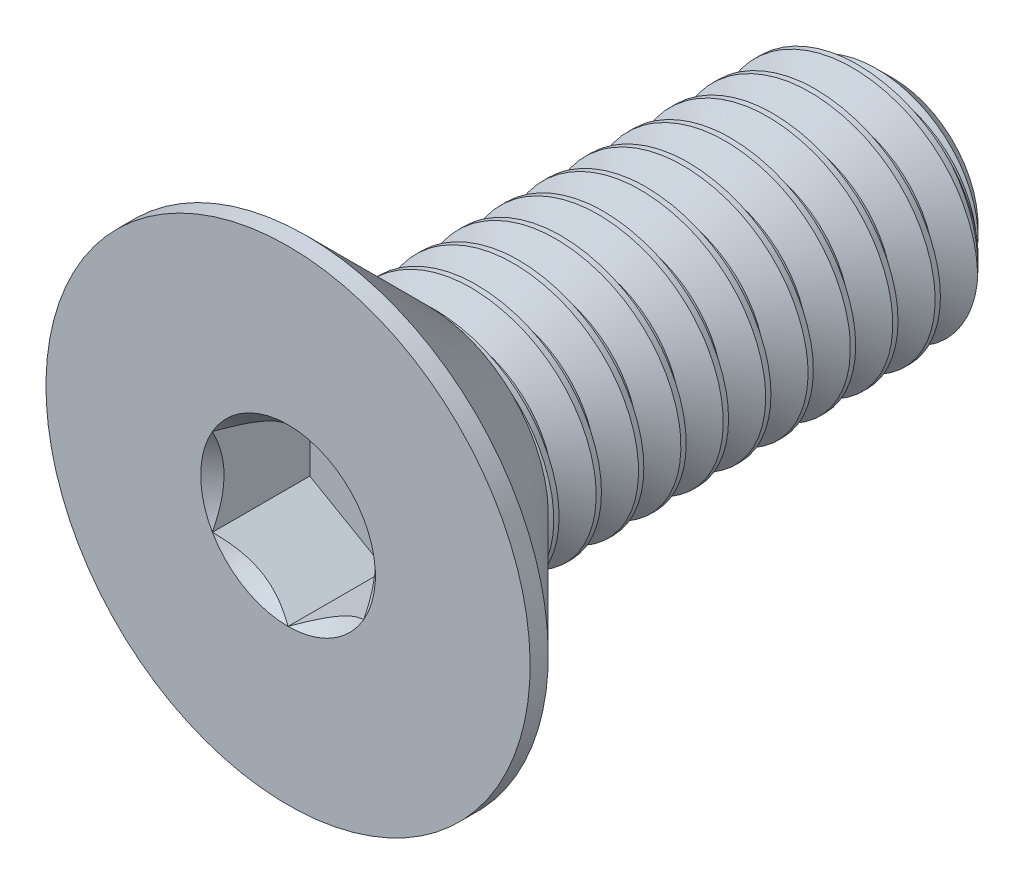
from build123d import *

# Parameters (mm, degrees)
SKETCH3_W          = 10
SKETCH3_H          = 2
CHAMFER1_SIZE      = 0.6
CUT_EXTRUDE1_DEPTH = 1.61


with BuildPart() as part:
    # Sketch3 → Revolve1 (revolve)
    with BuildSketch(Plane(origin=(0, 0, 0), x_dir=(0, 0, -1), z_dir=(1, 0, 0))):
        with Locations((0, 1)):
            Rectangle(SKETCH3_W, SKETCH3_H)
    revolve(axis=Axis((0, 0, -5), (0, 0, 1)))

    # Chamfer1
    chamfer1_edges = [part.edges().sort_by_distance(p)[0] for p in [
        (0, -2, -5),
    ]]
    chamfer(chamfer1_edges, length=CHAMFER1_SIZE)

    # Sketch6 → Revolve2 (revolve)
    with BuildSketch(Plane(origin=(0, 0, 0), x_dir=(0, 0, -1), z_dir=(1, 0, 0))):
        Polygon((-5, 4), (-4.7, 4), (-2.7, 2), (-2.7, 0), (-5, 0), align=None)
    revolve(axis=Axis((0, 0, -5), (0, 0, 1)))

    # Sketch8 → Cut-Extrude1 (cut)
    with BuildSketch(Plane.XY.offset(5)):
        Polygon((0, 1.443375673), (-1.25, 0.721687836), (-1.25, -0.721687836), (0, -1.443375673), (1.25, -0.721687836), (1.25, 0.721687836), align=None)
    extrude(amount=-CUT_EXTRUDE1_DEPTH, mode=Mode.SUBTRACT)

    # Cut-Extrude2 cone 1 section (on through the dimple's axis) → Cut-Extrude2 (revolve, cut)
    with BuildSketch(Plane(origin=(0, 0, 5), x_dir=(0, -1, 0), z_dir=(1, 0, 0))):
        Polygon((0, 0), (1.443375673, 0), (0, 1.443375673), align=None)
    revolve(axis=Axis((0, 0, 5), (0, 0, -1)), mode=Mode.SUBTRACT)


with BuildPart() as body_2:
    # Split1: the piece on the far side of the plane
    add(part.part)
    split(bisect_by=Plane.XY.offset(2.7), keep=Keep.BOTTOM)

    # Cut-Sweep1: sweep along a curve in space
    with BuildLine() as cut_sweep1_path:
        add(Edge.make_bspline(
            [(0, 2, -5), (-0.26012564, 2, -4.985509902), (-0.786052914, 1.895863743, -4.95620673), (-1.45082753, 1.451031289, -4.912511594), (-1.89591834, 0.785292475, -4.868746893), (-2.052053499, 0, -4.825000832), (-1.895867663, -0.785292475, -4.781249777), (-1.451030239, -1.451031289, -4.73750006), (-0.785292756, -1.895863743, -4.693749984), (7.5e-08, -2.052068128, -4.650000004), (0.785292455, -1.895863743, -4.606249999), (1.451031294, -1.451031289, -4.5625), (1.895863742, -0.785292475, -4.51875), (2.052068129, 0, -4.475), (1.895863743, 0.785292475, -4.43125), (1.451031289, 1.451031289, -4.3875), (0.785292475, 1.895863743, -4.34375), (0, 2.052068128, -4.3), (-0.785292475, 1.895863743, -4.25625), (-1.451031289, 1.451031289, -4.2125), (-1.895863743, 0.785292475, -4.16875), (-2.052068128, 0, -4.125), (-1.895863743, -0.785292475, -4.08125), (-1.451031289, -1.451031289, -4.0375), (-0.785292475, -1.895863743, -3.99375), (0, -2.052068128, -3.95), (0.785292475, -1.895863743, -3.90625), (1.451031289, -1.451031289, -3.8625), (1.895863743, -0.785292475, -3.81875), (2.052068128, 0, -3.775), (1.895863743, 0.785292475, -3.73125), (1.451031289, 1.451031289, -3.6875), (0.785292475, 1.895863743, -3.64375), (0, 2.052068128, -3.6), (-0.785292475, 1.895863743, -3.55625), (-1.451031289, 1.451031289, -3.5125), (-1.895863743, 0.785292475, -3.46875), (-2.052068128, 0, -3.425), (-1.895863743, -0.785292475, -3.38125), (-1.451031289, -1.451031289, -3.3375), (-0.785292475, -1.895863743, -3.29375), (0, -2.052068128, -3.25), (0.785292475, -1.895863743, -3.20625), (1.451031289, -1.451031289, -3.1625), (1.895863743, -0.785292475, -3.11875), (2.052068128, 0, -3.075), (1.895863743, 0.785292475, -3.03125), (1.451031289, 1.451031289, -2.9875), (0.785292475, 1.895863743, -2.94375), (0, 2.052068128, -2.9), (-0.785292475, 1.895863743, -2.85625), (-1.451031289, 1.451031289, -2.8125), (-1.895863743, 0.785292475, -2.76875), (-2.052068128, 0, -2.725), (-1.895863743, -0.785292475, -2.68125), (-1.451031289, -1.451031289, -2.6375), (-0.785292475, -1.895863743, -2.59375), (0, -2.052068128, -2.55), (0.785292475, -1.895863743, -2.50625), (1.451031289, -1.451031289, -2.4625), (1.895863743, -0.785292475, -2.41875), (2.052068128, 0, -2.375), (1.895863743, 0.785292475, -2.33125), (1.451031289, 1.451031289, -2.2875), (0.785292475, 1.895863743, -2.24375), (0, 2.052068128, -2.2), (-0.785292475, 1.895863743, -2.15625), (-1.451031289, 1.451031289, -2.1125), (-1.895863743, 0.785292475, -2.06875), (-2.052068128, 0, -2.025), (-1.895863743, -0.785292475, -1.98125), (-1.451031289, -1.451031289, -1.9375), (-0.785292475, -1.895863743, -1.89375), (0, -2.052068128, -1.85), (0.785292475, -1.895863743, -1.80625), (1.451031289, -1.451031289, -1.7625), (1.895863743, -0.785292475, -1.71875), (2.052068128, 0, -1.675), (1.895863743, 0.785292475, -1.63125), (1.451031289, 1.451031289, -1.5875), (0.785292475, 1.895863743, -1.54375), (0, 2.052068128, -1.5), (-0.785292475, 1.895863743, -1.45625), (-1.451031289, 1.451031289, -1.4125), (-1.895863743, 0.785292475, -1.36875), (-2.052068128, 0, -1.325), (-1.895863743, -0.785292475, -1.28125), (-1.451031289, -1.451031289, -1.2375), (-0.785292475, -1.895863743, -1.19375), (0, -2.052068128, -1.15), (0.785292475, -1.895863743, -1.10625), (1.451031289, -1.451031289, -1.0625), (1.895863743, -0.785292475, -1.01875), (2.052068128, 0, -0.975), (1.895863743, 0.785292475, -0.93125), (1.451031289, 1.451031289, -0.8875), (0.785292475, 1.895863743, -0.84375), (0, 2.052068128, -0.8), (-0.785292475, 1.895863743, -0.75625), (-1.451031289, 1.451031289, -0.7125), (-1.895863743, 0.785292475, -0.66875), (-2.052068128, 0, -0.625), (-1.895863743, -0.785292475, -0.58125), (-1.451031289, -1.451031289, -0.5375), (-0.785292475, -1.895863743, -0.49375), (0, -2.052068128, -0.45), (0.785292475, -1.895863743, -0.40625), (1.451031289, -1.451031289, -0.3625), (1.895863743, -0.785292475, -0.31875), (2.052068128, 0, -0.275), (1.895863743, 0.785292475, -0.23125), (1.451031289, 1.451031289, -0.1875), (0.785292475, 1.895863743, -0.14375), (0, 2.052068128, -0.1), (-0.785292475, 1.895863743, -0.05625), (-1.451031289, 1.451031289, -0.0125), (-1.895863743, 0.785292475, 0.03125), (-2.052068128, 0, 0.075), (-1.895863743, -0.785292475, 0.11875), (-1.451031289, -1.451031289, 0.1625), (-0.785292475, -1.895863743, 0.20625), (0, -2.052068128, 0.25), (0.785292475, -1.895863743, 0.29375), (1.451031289, -1.451031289, 0.3375), (1.895863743, -0.785292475, 0.38125), (2.052068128, 0, 0.425), (1.895863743, 0.785292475, 0.46875), (1.451031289, 1.451031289, 0.5125), (0.785292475, 1.895863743, 0.55625), (0, 2.052068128, 0.6), (-0.785292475, 1.895863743, 0.64375), (-1.451031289, 1.451031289, 0.6875), (-1.895863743, 0.785292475, 0.73125), (-2.052068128, 0, 0.775), (-1.895863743, -0.785292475, 0.81875), (-1.451031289, -1.451031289, 0.8625), (-0.785292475, -1.895863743, 0.90625), (0, -2.052068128, 0.95), (0.785292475, -1.895863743, 0.99375), (1.451031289, -1.451031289, 1.0375), (1.895863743, -0.785292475, 1.08125), (2.052068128, 0, 1.125), (1.895863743, 0.785292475, 1.16875), (1.451031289, 1.451031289, 1.2125), (0.785292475, 1.895863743, 1.25625), (0, 2.052068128, 1.3), (-0.785292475, 1.895863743, 1.34375), (-1.451031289, 1.451031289, 1.3875), (-1.895863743, 0.785292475, 1.43125), (-2.052068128, 0, 1.475), (-1.895863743, -0.785292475, 1.51875), (-1.451031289, -1.451031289, 1.5625), (-0.785292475, -1.895863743, 1.60625), (0, -2.052068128, 1.65), (0.785292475, -1.895863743, 1.69375), (1.451031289, -1.451031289, 1.7375), (1.895863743, -0.785292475, 1.78125), (2.052068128, 0, 1.825), (1.895863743, 0.785292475, 1.86875), (1.451031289, 1.451031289, 1.9125), (0.785292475, 1.895863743, 1.95625), (0, 2.052068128, 2), (-0.785292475, 1.895863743, 2.04375), (-1.451031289, 1.451031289, 2.0875), (-1.895863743, 0.785292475, 2.13125), (-2.052068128, 0, 2.175), (-1.895863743, -0.785292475, 2.21875), (-1.451031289, -1.451031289, 2.2625), (-0.785292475, -1.895863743, 2.30625), (0, -2.052068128, 2.35), (0.785292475, -1.895863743, 2.39375), (1.451031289, -1.451031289, 2.4375), (1.895863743, -0.785292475, 2.48125), (2.052068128, 0, 2.525), (1.895863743, 0.785292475, 2.56875), (1.451031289, 1.451031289, 2.6125), (0.785292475, 1.895863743, 2.65625), (0, 2.052068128, 2.7), (-0.785292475, 1.895863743, 2.74375), (-1.451031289, 1.451031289, 2.7875), (-1.895863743, 0.785292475, 2.83125), (-2.052068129, 0, 2.875), (-1.895863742, -0.785292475, 2.91875), (-1.451031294, -1.451031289, 2.9625), (-0.785292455, -1.895863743, 3.006249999), (-7.5e-08, -2.052068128, 3.050000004), (0.785292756, -1.895863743, 3.093749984), (1.451030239, -1.451031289, 3.13750006), (1.895867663, -0.785292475, 3.181249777), (2.052053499, 0, 3.225000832), (1.89591834, 0.785292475, 3.268746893), (1.45082753, 1.451031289, 3.312511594), (0.786052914, 1.895863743, 3.35620673), (0.26012564, 2, 3.385509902), (0, 2, 3.4)],
            knots=[0, 0, 0, 0, 0.005208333, 0.010416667, 0.015625, 0.020833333, 0.026041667, 0.03125, 0.036458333, 0.041666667, 0.046875, 0.052083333, 0.057291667, 0.0625, 0.067708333, 0.072916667, 0.078125, 0.083333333, 0.088541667, 0.09375, 0.098958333, 0.104166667, 0.109375, 0.114583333, 0.119791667, 0.125, 0.130208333, 0.135416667, 0.140625, 0.145833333, 0.151041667, 0.15625, 0.161458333, 0.166666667, 0.171875, 0.177083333, 0.182291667, 0.1875, 0.192708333, 0.197916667, 0.203125, 0.208333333, 0.213541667, 0.21875, 0.223958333, 0.229166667, 0.234375, 0.239583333, 0.244791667, 0.25, 0.255208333, 0.260416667, 0.265625, 0.270833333, 0.276041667, 0.28125, 0.286458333, 0.291666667, 0.296875, 0.302083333, 0.307291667, 0.3125, 0.317708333, 0.322916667, 0.328125, 0.333333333, 0.338541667, 0.34375, 0.348958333, 0.354166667, 0.359375, 0.364583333, 0.369791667, 0.375, 0.380208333, 0.385416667, 0.390625, 0.395833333, 0.401041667, 0.40625, 0.411458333, 0.416666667, 0.421875, 0.427083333, 0.432291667, 0.4375, 0.442708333, 0.447916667, 0.453125, 0.458333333, 0.463541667, 0.46875, 0.473958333, 0.479166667, 0.484375, 0.489583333, 0.494791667, 0.5, 0.505208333, 0.510416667, 0.515625, 0.520833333, 0.526041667, 0.53125, 0.536458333, 0.541666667, 0.546875, 0.552083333, 0.557291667, 0.5625, 0.567708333, 0.572916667, 0.578125, 0.583333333, 0.588541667, 0.59375, 0.598958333, 0.604166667, 0.609375, 0.614583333, 0.619791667, 0.625, 0.630208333, 0.635416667, 0.640625, 0.645833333, 0.651041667, 0.65625, 0.661458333, 0.666666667, 0.671875, 0.677083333, 0.682291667, 0.6875, 0.692708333, 0.697916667, 0.703125, 0.708333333, 0.713541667, 0.71875, 0.723958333, 0.729166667, 0.734375, 0.739583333, 0.744791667, 0.75, 0.755208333, 0.760416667, 0.765625, 0.770833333, 0.776041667, 0.78125, 0.786458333, 0.791666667, 0.796875, 0.802083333, 0.807291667, 0.8125, 0.817708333, 0.822916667, 0.828125, 0.833333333, 0.838541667, 0.84375, 0.848958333, 0.854166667, 0.859375, 0.864583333, 0.869791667, 0.875, 0.880208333, 0.885416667, 0.890625, 0.895833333, 0.901041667, 0.90625, 0.911458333, 0.916666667, 0.921875, 0.927083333, 0.932291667, 0.9375, 0.942708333, 0.947916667, 0.953125, 0.958333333, 0.963541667, 0.96875, 0.973958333, 0.979166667, 0.984375, 0.989583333, 0.994791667, 1, 1, 1, 1], degree=3))
    # Sketch10 → Cut-Sweep1 (sweep, cut)
    with BuildSketch(Plane(origin=(0, 0, 0), x_dir=(0, 0, -1), z_dir=(1, 0, 0))):
        Polygon((4.978125, 2.037888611), (5.634375, 2.037888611), (5.35, 1.545336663), (5.2625, 1.545336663), align=None)
    sweep(path=cut_sweep1_path.line, is_frenet=True, mode=Mode.SUBTRACT)


with BuildPart() as part_1:
    add(part.part)

    # Split1
    split(bisect_by=Plane.XY.offset(2.7), keep=Keep.TOP)


solid = Compound([body_2.part, part_1.part])
